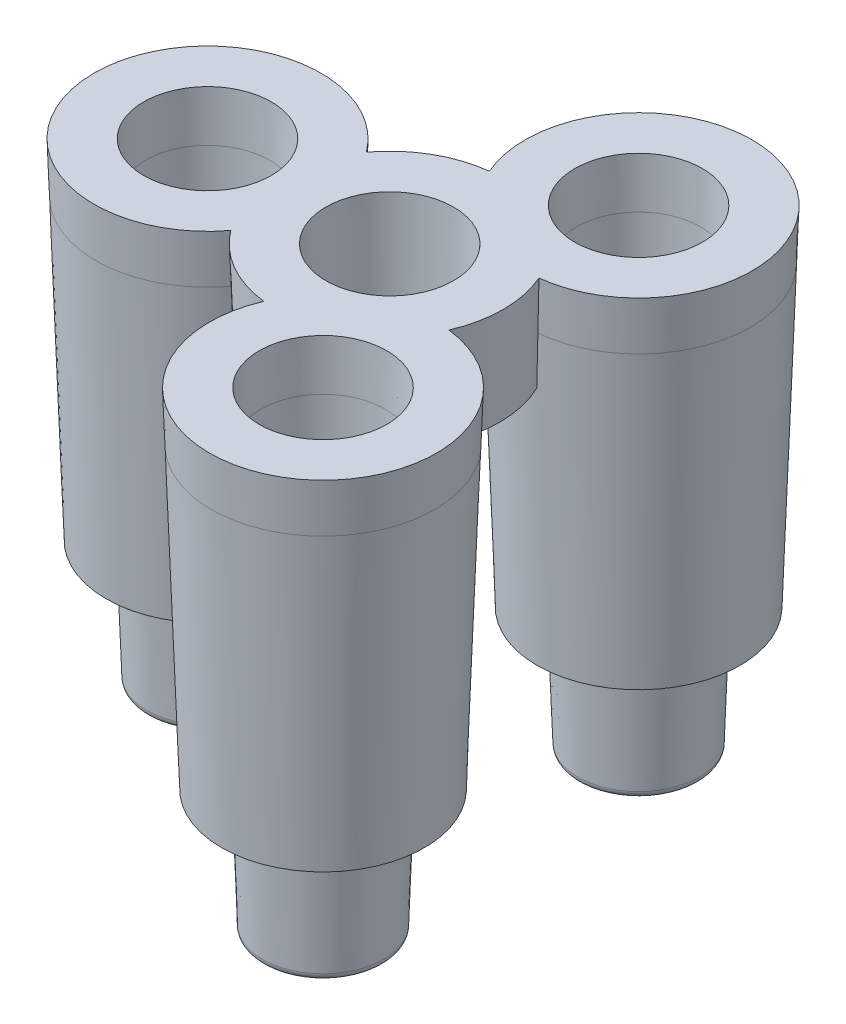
ISO-10303-21;
HEADER;
FILE_DESCRIPTION(('STEP AP214'),'2;1');
FILE_NAME('part.step','',(''),(''),'','','');
FILE_SCHEMA(('AUTOMOTIVE_DESIGN { 1 0 10303 214 1 1 1 1 }'));
ENDSEC;
DATA;
#1=APPLICATION_CONTEXT('core data for automotive mechanical design processes');
#2=APPLICATION_PROTOCOL_DEFINITION('international standard','automotive_design',2000,#1);
#3=PRODUCT_CONTEXT('',#1,'mechanical');
#4=PRODUCT('Part','Part','',(#3));
#5=PRODUCT_RELATED_PRODUCT_CATEGORY('part','',(#4));
#6=PRODUCT_DEFINITION_FORMATION('','',#4);
#7=PRODUCT_DEFINITION_CONTEXT('part definition',#1,'design');
#8=PRODUCT_DEFINITION('design','',#6,#7);
#9=PRODUCT_DEFINITION_SHAPE('','',#8);
#10=(LENGTH_UNIT() NAMED_UNIT(*) SI_UNIT(.MILLI.,.METRE.));
#11=(NAMED_UNIT(*) PLANE_ANGLE_UNIT() SI_UNIT($,.RADIAN.));
#12=(NAMED_UNIT(*) SI_UNIT($,.STERADIAN.) SOLID_ANGLE_UNIT());
#13=UNCERTAINTY_MEASURE_WITH_UNIT(LENGTH_MEASURE(1.E-05),#10,'distance_accuracy_value','');
#14=(GEOMETRIC_REPRESENTATION_CONTEXT(3) GLOBAL_UNCERTAINTY_ASSIGNED_CONTEXT((#13)) GLOBAL_UNIT_ASSIGNED_CONTEXT((#10,
#11,#12)) REPRESENTATION_CONTEXT('',''));
#15=CARTESIAN_POINT('',(0.,0.,0.));
#16=DIRECTION('',(0.,0.,1.));
#17=DIRECTION('',(1.,0.,0.));
#18=AXIS2_PLACEMENT_3D('',#15,#16,#17);
#19=CARTESIAN_POINT('',(7.33333333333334,0.,0.));
#20=DIRECTION('',(0.,1.,0.));
#21=DIRECTION('',(-0.866025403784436,0.,-0.500000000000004));
#22=AXIS2_PLACEMENT_3D('',#19,#20,#21);
#23=CONICAL_SURFACE('',#22,4.5,0.0349065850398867);
#24=CARTESIAN_POINT('',(11.4363348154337,0.2002,1.86503296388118));
#25=CARTESIAN_POINT('',(11.4155381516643,-0.199895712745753,1.8770399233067));
#26=CARTESIAN_POINT('',(11.3945360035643,-0.599976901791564,1.88916551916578));
#27=CARTESIAN_POINT('',(11.3521207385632,-1.40011023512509,1.91365398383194));
#28=CARTESIAN_POINT('',(11.3307076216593,-1.80016237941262,1.92601685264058));
#29=CARTESIAN_POINT('',(11.3090890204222,-2.20020000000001,1.93849835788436));
#30=B_SPLINE_CURVE_WITH_KNOTS('',3,(#24,#25,#26,#27,#28,#29),.UNSPECIFIED.,.F.,.F.,(4,2,4),(0.,
1.20244654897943,2.40489310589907),.UNSPECIFIED.);
#31=CARTESIAN_POINT('',(11.4259069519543,0.,1.8710534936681));
#32=VERTEX_POINT('',#31);
#33=CARTESIAN_POINT('',(11.3198955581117,-2.,1.93225920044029));
#34=VERTEX_POINT('',#33);
#35=EDGE_CURVE('E380',#32,#34,#30,.T.);
#36=ORIENTED_EDGE('',*,*,#35,.T.);
#37=CARTESIAN_POINT('',(7.33333333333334,-2.,0.));
#38=DIRECTION('',(0.,-1.,0.));
#39=DIRECTION('',(0.866025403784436,0.,0.500000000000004));
#40=AXIS2_PLACEMENT_3D('',#37,#38,#39);
#41=CIRCLE('',#40,4.43015846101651);
#42=CARTESIAN_POINT('',(11.3198955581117,-2.,-1.93225920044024));
#43=VERTEX_POINT('',#42);
#44=EDGE_CURVE('E271',#43,#34,#41,.T.);
#45=ORIENTED_EDGE('',*,*,#44,.F.);
#46=CARTESIAN_POINT('',(11.3090890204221,-2.2002,-1.93849835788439));
#47=CARTESIAN_POINT('',(11.3307076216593,-1.80016237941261,-1.92601685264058));
#48=CARTESIAN_POINT('',(11.3521207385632,-1.40011023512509,-1.91365398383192));
#49=CARTESIAN_POINT('',(11.3945360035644,-0.599976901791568,-1.88916551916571));
#50=CARTESIAN_POINT('',(11.4155381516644,-0.19989571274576,-1.8770399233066));
#51=CARTESIAN_POINT('',(11.4363348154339,0.20019999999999,-1.86503296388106));
#52=B_SPLINE_CURVE_WITH_KNOTS('',3,(#46,#47,#48,#49,#50,#51),.UNSPECIFIED.,.F.,.F.,(4,2,4),(0.,
1.20244655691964,2.40489310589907),.UNSPECIFIED.);
#53=CARTESIAN_POINT('',(11.4259069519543,0.,-1.87105349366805));
#54=VERTEX_POINT('',#53);
#55=EDGE_CURVE('E234',#43,#54,#52,.T.);
#56=ORIENTED_EDGE('',*,*,#55,.T.);
#57=CARTESIAN_POINT('',(11.4154470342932,-0.2002,-1.87709252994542));
#58=CARTESIAN_POINT('',(11.4363706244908,0.19984214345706,-1.86501228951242));
#59=CARTESIAN_POINT('',(11.4571153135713,0.599896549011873,-1.85303533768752));
#60=CARTESIAN_POINT('',(11.4982468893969,1.40002988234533,-1.82928801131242));
#61=CARTESIAN_POINT('',(11.5186337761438,1.80010881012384,-1.81751763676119));
#62=CARTESIAN_POINT('',(11.5388417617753,2.2002,-1.80585055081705));
#63=B_SPLINE_CURVE_WITH_KNOTS('',3,(#57,#58,#59,#60,#61,#62),.UNSPECIFIED.,.F.,.F.,(4,2,4),(0.,
1.20231270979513,2.40462541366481),.UNSPECIFIED.);
#64=CARTESIAN_POINT('',(11.5287114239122,2.,-1.8116993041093));
#65=VERTEX_POINT('',#64);
#66=EDGE_CURVE('E198',#54,#65,#63,.T.);
#67=ORIENTED_EDGE('',*,*,#66,.T.);
#68=CARTESIAN_POINT('',(7.33333333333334,2.,0.));
#69=DIRECTION('',(0.,1.,0.));
#70=DIRECTION('',(-0.866025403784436,0.,-0.500000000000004));
#71=AXIS2_PLACEMENT_3D('',#68,#69,#70);
#72=CIRCLE('',#71,4.5698415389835);
#73=CARTESIAN_POINT('',(11.5287114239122,2.,1.81169930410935));
#74=VERTEX_POINT('',#73);
#75=EDGE_CURVE('E343',#74,#65,#72,.T.);
#76=ORIENTED_EDGE('',*,*,#75,.F.);
#77=CARTESIAN_POINT('',(11.5388417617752,2.2002,1.80585055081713));
#78=CARTESIAN_POINT('',(11.5186337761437,1.80010881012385,1.81751763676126));
#79=CARTESIAN_POINT('',(11.4982468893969,1.40002988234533,1.82928801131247));
#80=CARTESIAN_POINT('',(11.4571153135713,0.599896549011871,1.85303533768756));
#81=CARTESIAN_POINT('',(11.4363706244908,0.199842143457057,1.86501228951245));
#82=CARTESIAN_POINT('',(11.4154470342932,-0.200200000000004,1.87709252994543));
#83=B_SPLINE_CURVE_WITH_KNOTS('',3,(#77,#78,#79,#80,#81,#82),.UNSPECIFIED.,.F.,.F.,(4,2,4),(0.,
1.20231270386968,2.40462541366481),.UNSPECIFIED.);
#84=EDGE_CURVE('E395',#74,#32,#83,.T.);
#85=ORIENTED_EDGE('',*,*,#84,.T.);
#86=EDGE_LOOP('',(#36,#45,#56,#67,#76,#85));
#87=FACE_BOUND('',#86,.T.);
#88=ADVANCED_FACE('F36',(#87),#23,.T.);
#89=CARTESIAN_POINT('',(7.33333333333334,0.,0.));
#90=DIRECTION('',(0.,1.,0.));
#91=DIRECTION('',(-0.866025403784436,0.,-0.500000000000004));
#92=AXIS2_PLACEMENT_3D('',#89,#90,#91);
#93=CONICAL_SURFACE('',#92,4.5,0.0349065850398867);
#94=CARTESIAN_POINT('',(3.66666666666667,-2.2002,-2.47385624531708));
#95=CARTESIAN_POINT('',(3.66666666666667,-1.80016237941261,-2.49881925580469));
#96=CARTESIAN_POINT('',(3.66666666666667,-1.40011023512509,-2.52354499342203));
#97=CARTESIAN_POINT('',(3.66666666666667,-0.599976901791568,-2.57252192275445));
#98=CARTESIAN_POINT('',(3.66666666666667,-0.19989571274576,-2.59677311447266));
#99=CARTESIAN_POINT('',(3.66666666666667,0.20019999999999,-2.62078703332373));
#100=B_SPLINE_CURVE_WITH_KNOTS('',3,(#94,#95,#96,#97,#98,#99),.UNSPECIFIED.,.F.,.F.,(4,2,4),(0.,
1.20244655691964,2.40489310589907),.UNSPECIFIED.);
#101=CARTESIAN_POINT('',(3.66666666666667,-2.,-2.48633456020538));
#102=VERTEX_POINT('',#101);
#103=CARTESIAN_POINT('',(3.66666666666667,0.,-2.60874597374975));
#104=VERTEX_POINT('',#103);
#105=EDGE_CURVE('E52',#102,#104,#100,.T.);
#106=ORIENTED_EDGE('',*,*,#105,.T.);
#107=CARTESIAN_POINT('',(3.66666666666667,-0.2002,-2.59666790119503));
#108=CARTESIAN_POINT('',(3.66666666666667,0.19984214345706,-2.62082838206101));
#109=CARTESIAN_POINT('',(3.66666666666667,0.599896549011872,-2.64478228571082));
#110=CARTESIAN_POINT('',(3.66666666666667,1.40002988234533,-2.69227693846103));
#111=CARTESIAN_POINT('',(3.66666666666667,1.80010881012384,-2.71581768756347));
#112=CARTESIAN_POINT('',(3.66666666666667,2.2002,-2.73915185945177));
#113=B_SPLINE_CURVE_WITH_KNOTS('',3,(#107,#108,#109,#110,#111,#112),.UNSPECIFIED.,.F.,.F.,(4,2,
4),(0.,1.20231270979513,2.40462541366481),.UNSPECIFIED.);
#114=CARTESIAN_POINT('',(3.66666666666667,2.,-2.72745435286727));
#115=VERTEX_POINT('',#114);
#116=EDGE_CURVE('E110',#104,#115,#113,.T.);
#117=ORIENTED_EDGE('',*,*,#116,.T.);
#118=CARTESIAN_POINT('',(7.33333333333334,2.,0.));
#119=DIRECTION('',(0.,1.,0.));
#120=DIRECTION('',(-0.866025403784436,0.,-0.500000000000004));
#121=AXIS2_PLACEMENT_3D('',#118,#119,#120);
#122=CIRCLE('',#121,4.5698415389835);
#123=CARTESIAN_POINT('',(6.80462190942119,2.,-4.53915365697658));
#124=VERTEX_POINT('',#123);
#125=EDGE_CURVE('E476',#124,#115,#122,.T.);
#126=ORIENTED_EDGE('',*,*,#125,.F.);
#127=CARTESIAN_POINT('',(6.79449157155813,2.2002,-4.5450024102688));
#128=CARTESIAN_POINT('',(6.81469955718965,1.80010881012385,-4.53333532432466));
#129=CARTESIAN_POINT('',(6.83508644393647,1.40002988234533,-4.52156494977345));
#130=CARTESIAN_POINT('',(6.87621801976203,0.599896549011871,-4.49781762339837));
#131=CARTESIAN_POINT('',(6.89696270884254,0.199842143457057,-4.48584067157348));
#132=CARTESIAN_POINT('',(6.91788629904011,-0.200200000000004,-4.4737604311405));
#133=B_SPLINE_CURVE_WITH_KNOTS('',3,(#127,#128,#129,#130,#131,#132),.UNSPECIFIED.,.F.,.F.,(4,2,
4),(0.,1.20231270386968,2.40462541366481),.UNSPECIFIED.);
#134=CARTESIAN_POINT('',(6.90742638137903,0.,-4.47979946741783));
#135=VERTEX_POINT('',#134);
#136=EDGE_CURVE('E207',#124,#135,#133,.T.);
#137=ORIENTED_EDGE('',*,*,#136,.T.);
#138=CARTESIAN_POINT('',(6.89699851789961,0.2002,-4.48581999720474));
#139=CARTESIAN_POINT('',(6.91779518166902,-0.199895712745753,-4.47381303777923));
#140=CARTESIAN_POINT('',(6.93879732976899,-0.599976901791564,-4.46168744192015));
#141=CARTESIAN_POINT('',(6.98121259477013,-1.40011023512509,-4.43719897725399));
#142=CARTESIAN_POINT('',(7.00262571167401,-1.80016237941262,-4.42483610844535));
#143=CARTESIAN_POINT('',(7.02424431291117,-2.20020000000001,-4.41235460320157));
#144=B_SPLINE_CURVE_WITH_KNOTS('',3,(#138,#139,#140,#141,#142,#143),.UNSPECIFIED.,.F.,.F.,(4,2,
4),(0.,1.20244654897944,2.40489310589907),.UNSPECIFIED.);
#145=CARTESIAN_POINT('',(7.01343777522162,-2.,-4.41859376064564));
#146=VERTEX_POINT('',#145);
#147=EDGE_CURVE('E241',#135,#146,#144,.T.);
#148=ORIENTED_EDGE('',*,*,#147,.T.);
#149=CARTESIAN_POINT('',(7.33333333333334,-2.,0.));
#150=DIRECTION('',(0.,-1.,0.));
#151=DIRECTION('',(0.866025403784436,0.,0.500000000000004));
#152=AXIS2_PLACEMENT_3D('',#149,#150,#151);
#153=CIRCLE('',#152,4.43015846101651);
#154=EDGE_CURVE('E130',#102,#146,#153,.T.);
#155=ORIENTED_EDGE('',*,*,#154,.F.);
#156=EDGE_LOOP('',(#106,#117,#126,#137,#148,#155));
#157=FACE_BOUND('',#156,.T.);
#158=ADVANCED_FACE('F128',(#157),#93,.T.);
#159=CARTESIAN_POINT('',(7.33333333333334,0.,0.));
#160=DIRECTION('',(0.,1.,0.));
#161=DIRECTION('',(-0.866025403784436,0.,-0.500000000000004));
#162=AXIS2_PLACEMENT_3D('',#159,#160,#161);
#163=CONICAL_SURFACE('',#162,4.5,0.0349065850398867);
#164=CARTESIAN_POINT('',(7.02424431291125,-2.2002,4.41235460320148));
#165=CARTESIAN_POINT('',(7.00262571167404,-1.80016237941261,4.42483610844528));
#166=CARTESIAN_POINT('',(6.98121259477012,-1.40011023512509,4.43719897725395));
#167=CARTESIAN_POINT('',(6.93879732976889,-0.599976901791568,4.46168744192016));
#168=CARTESIAN_POINT('',(6.91779518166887,-0.19989571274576,4.47381303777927));
#169=CARTESIAN_POINT('',(6.89699851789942,0.20019999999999,4.4858199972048));
#170=B_SPLINE_CURVE_WITH_KNOTS('',3,(#164,#165,#166,#167,#168,#169),.UNSPECIFIED.,.F.,.F.,(4,2,
4),(0.,1.20244655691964,2.40489310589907),.UNSPECIFIED.);
#171=CARTESIAN_POINT('',(7.01343777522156,-2.,4.41859376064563));
#172=VERTEX_POINT('',#171);
#173=CARTESIAN_POINT('',(6.90742638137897,0.,4.47979946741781));
#174=VERTEX_POINT('',#173);
#175=EDGE_CURVE('E60',#172,#174,#170,.T.);
#176=ORIENTED_EDGE('',*,*,#175,.T.);
#177=CARTESIAN_POINT('',(6.91788629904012,-0.2002,4.47376043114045));
#178=CARTESIAN_POINT('',(6.89696270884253,0.19984214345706,4.48584067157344));
#179=CARTESIAN_POINT('',(6.87621801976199,0.599896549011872,4.49781762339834));
#180=CARTESIAN_POINT('',(6.83508644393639,1.40002988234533,4.52156494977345));
#181=CARTESIAN_POINT('',(6.81469955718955,1.80010881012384,4.53333532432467));
#182=CARTESIAN_POINT('',(6.79449157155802,2.2002,4.54500241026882));
#183=B_SPLINE_CURVE_WITH_KNOTS('',3,(#177,#178,#179,#180,#181,#182),.UNSPECIFIED.,.F.,.F.,(4,2,
4),(0.,1.20231270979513,2.40462541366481),.UNSPECIFIED.);
#184=CARTESIAN_POINT('',(6.80462190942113,2.,4.53915365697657));
#185=VERTEX_POINT('',#184);
#186=EDGE_CURVE('E402',#174,#185,#183,.T.);
#187=ORIENTED_EDGE('',*,*,#186,.T.);
#188=CARTESIAN_POINT('',(7.33333333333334,2.,0.));
#189=DIRECTION('',(0.,1.,0.));
#190=DIRECTION('',(-0.866025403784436,0.,-0.500000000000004));
#191=AXIS2_PLACEMENT_3D('',#188,#189,#190);
#192=CIRCLE('',#191,4.5698415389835);
#193=CARTESIAN_POINT('',(3.66666666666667,2.,2.72745435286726));
#194=VERTEX_POINT('',#193);
#195=EDGE_CURVE('E474',#194,#185,#192,.T.);
#196=ORIENTED_EDGE('',*,*,#195,.F.);
#197=CARTESIAN_POINT('',(3.66666666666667,2.2002,2.7391518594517));
#198=CARTESIAN_POINT('',(3.66666666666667,1.80010881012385,2.71581768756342));
#199=CARTESIAN_POINT('',(3.66666666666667,1.40002988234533,2.692276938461));
#200=CARTESIAN_POINT('',(3.66666666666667,0.599896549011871,2.64478228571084));
#201=CARTESIAN_POINT('',(3.66666666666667,0.199842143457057,2.62082838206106));
#202=CARTESIAN_POINT('',(3.66666666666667,-0.200200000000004,2.59666790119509));
#203=B_SPLINE_CURVE_WITH_KNOTS('',3,(#197,#198,#199,#200,#201,#202),.UNSPECIFIED.,.F.,.F.,(4,2,
4),(0.,1.20231270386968,2.40462541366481),.UNSPECIFIED.);
#204=CARTESIAN_POINT('',(3.66666666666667,0.,2.60874597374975));
#205=VERTEX_POINT('',#204);
#206=EDGE_CURVE('E119',#194,#205,#203,.T.);
#207=ORIENTED_EDGE('',*,*,#206,.T.);
#208=CARTESIAN_POINT('',(3.66666666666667,0.2002,2.62078703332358));
#209=CARTESIAN_POINT('',(3.66666666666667,-0.199895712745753,2.59677311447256));
#210=CARTESIAN_POINT('',(3.66666666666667,-0.599976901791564,2.57252192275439));
#211=CARTESIAN_POINT('',(3.66666666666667,-1.40011023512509,2.52354499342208));
#212=CARTESIAN_POINT('',(3.66666666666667,-1.80016237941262,2.49881925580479));
#213=CARTESIAN_POINT('',(3.66666666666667,-2.20020000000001,2.47385624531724));
#214=B_SPLINE_CURVE_WITH_KNOTS('',3,(#208,#209,#210,#211,#212,#213),.UNSPECIFIED.,.F.,.F.,(4,2,
4),(0.,1.20244654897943,2.40489310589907),.UNSPECIFIED.);
#215=CARTESIAN_POINT('',(3.66666666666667,-2.,2.48633456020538));
#216=VERTEX_POINT('',#215);
#217=EDGE_CURVE('E123',#205,#216,#214,.T.);
#218=ORIENTED_EDGE('',*,*,#217,.T.);
#219=CARTESIAN_POINT('',(7.33333333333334,-2.,0.));
#220=DIRECTION('',(0.,-1.,0.));
#221=DIRECTION('',(0.866025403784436,0.,0.500000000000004));
#222=AXIS2_PLACEMENT_3D('',#219,#220,#221);
#223=CIRCLE('',#222,4.43015846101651);
#224=EDGE_CURVE('E281',#172,#216,#223,.T.);
#225=ORIENTED_EDGE('',*,*,#224,.F.);
#226=EDGE_LOOP('',(#176,#187,#196,#207,#218,#225));
#227=FACE_BOUND('',#226,.T.);
#228=ADVANCED_FACE('F189',(#227),#163,.T.);
#229=CARTESIAN_POINT('',(3.66666666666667,-2.,0.));
#230=DIRECTION('',(0.,-1.,0.));
#231=DIRECTION('',(0.866025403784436,0.,0.500000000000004));
#232=AXIS2_PLACEMENT_3D('',#229,#230,#231);
#233=PLANE('',#232);
#234=CARTESIAN_POINT('',(7.33333333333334,-2.,0.));
#235=DIRECTION('',(0.,-1.,0.));
#236=DIRECTION('',(0.866025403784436,0.,0.500000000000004));
#237=AXIS2_PLACEMENT_3D('',#234,#235,#236);
#238=CIRCLE('',#237,2.4301584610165);
#239=CARTESIAN_POINT('',(9.43791229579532,-2.,1.21507923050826));
#240=VERTEX_POINT('',#239);
#241=EDGE_CURVE('E40',#240,#240,#238,.T.);
#242=ORIENTED_EDGE('',*,*,#241,.F.);
#243=EDGE_LOOP('',(#242));
#244=FACE_BOUND('',#243,.T.);
#245=ORIENTED_EDGE('',*,*,#44,.T.);
#246=CARTESIAN_POINT('',(10.9999999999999,-2.,6.35085296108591));
#247=DIRECTION('',(0.,-1.,0.));
#248=DIRECTION('',(-0.866025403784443,0.,0.499999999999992));
#249=AXIS2_PLACEMENT_3D('',#246,#247,#248);
#250=CIRCLE('',#249,4.4301584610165);
#251=EDGE_CURVE('E270',#172,#34,#250,.T.);
#252=ORIENTED_EDGE('',*,*,#251,.F.);
#253=ORIENTED_EDGE('',*,*,#224,.T.);
#254=CARTESIAN_POINT('',(0.,-2.,0.));
#255=DIRECTION('',(0.,-1.,0.));
#256=DIRECTION('',(0.,0.,-1.));
#257=AXIS2_PLACEMENT_3D('',#254,#255,#256);
#258=CIRCLE('',#257,4.4301584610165);
#259=EDGE_CURVE('E372',#102,#216,#258,.T.);
#260=ORIENTED_EDGE('',*,*,#259,.F.);
#261=ORIENTED_EDGE('',*,*,#154,.T.);
#262=CARTESIAN_POINT('',(11.,-2.,-6.35085296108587));
#263=DIRECTION('',(0.,-1.,0.));
#264=DIRECTION('',(0.866025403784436,0.,0.500000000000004));
#265=AXIS2_PLACEMENT_3D('',#262,#263,#264);
#266=CIRCLE('',#265,4.4301584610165);
#267=EDGE_CURVE('E12',#43,#146,#266,.T.);
#268=ORIENTED_EDGE('',*,*,#267,.F.);
#269=EDGE_LOOP('',(#245,#252,#253,#260,#261,#268));
#270=FACE_BOUND('',#269,.T.);
#271=ADVANCED_FACE('F230',(#244,#270),#233,.T.);
#272=CARTESIAN_POINT('',(11.,0.,-6.35085296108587));
#273=DIRECTION('',(0.,1.,0.));
#274=DIRECTION('',(0.866025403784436,0.,0.500000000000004));
#275=AXIS2_PLACEMENT_3D('',#272,#273,#274);
#276=CONICAL_SURFACE('',#275,4.5,0.0349065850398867);
#277=CARTESIAN_POINT('',(11.,-12.,-6.35085296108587));
#278=DIRECTION('',(0.,-1.,0.));
#279=DIRECTION('',(0.866025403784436,0.,0.500000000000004));
#280=AXIS2_PLACEMENT_3D('',#277,#278,#279);
#281=CIRCLE('',#280,4.08095076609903);
#282=CARTESIAN_POINT('',(14.5342070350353,-12.,-4.31037757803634));
#283=VERTEX_POINT('',#282);
#284=EDGE_CURVE('E206',#283,#283,#281,.T.);
#285=ORIENTED_EDGE('',*,*,#284,.F.);
#286=EDGE_LOOP('',(#285));
#287=FACE_BOUND('',#286,.T.);
#288=ORIENTED_EDGE('',*,*,#147,.F.);
#289=CARTESIAN_POINT('',(11.,0.,-6.35085296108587));
#290=DIRECTION('',(0.,-1.,0.));
#291=DIRECTION('',(0.866025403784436,0.,0.500000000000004));
#292=AXIS2_PLACEMENT_3D('',#289,#290,#291);
#293=CIRCLE('',#292,4.5);
#294=EDGE_CURVE('E294',#135,#54,#293,.T.);
#295=ORIENTED_EDGE('',*,*,#294,.T.);
#296=ORIENTED_EDGE('',*,*,#55,.F.);
#297=ORIENTED_EDGE('',*,*,#267,.T.);
#298=EDGE_LOOP('',(#288,#295,#296,#297));
#299=FACE_BOUND('',#298,.T.);
#300=ADVANCED_FACE('F219',(#287,#299),#276,.T.);
#301=CARTESIAN_POINT('',(11.,0.,-6.35085296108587));
#302=DIRECTION('',(0.,1.,0.));
#303=DIRECTION('',(-0.866025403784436,0.,-0.500000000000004));
#304=AXIS2_PLACEMENT_3D('',#301,#302,#303);
#305=CONICAL_SURFACE('',#304,4.5,0.0349065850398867);
#306=ORIENTED_EDGE('',*,*,#66,.F.);
#307=ORIENTED_EDGE('',*,*,#294,.F.);
#308=ORIENTED_EDGE('',*,*,#136,.F.);
#309=CARTESIAN_POINT('',(11.,2.,-6.35085296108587));
#310=DIRECTION('',(0.,1.,0.));
#311=DIRECTION('',(-0.866025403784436,0.,-0.500000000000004));
#312=AXIS2_PLACEMENT_3D('',#309,#310,#311);
#313=CIRCLE('',#312,4.56984153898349);
#314=EDGE_CURVE('E296',#65,#124,#313,.T.);
#315=ORIENTED_EDGE('',*,*,#314,.F.);
#316=EDGE_LOOP('',(#306,#307,#308,#315));
#317=FACE_BOUND('',#316,.T.);
#318=ADVANCED_FACE('F213',(#317),#305,.T.);
#319=CARTESIAN_POINT('',(11.,2.,-6.35085296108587));
#320=DIRECTION('',(0.,1.,0.));
#321=DIRECTION('',(-0.866025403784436,0.,-0.500000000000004));
#322=AXIS2_PLACEMENT_3D('',#319,#320,#321);
#323=PLANE('',#322);
#324=ORIENTED_EDGE('',*,*,#75,.T.);
#325=ORIENTED_EDGE('',*,*,#314,.T.);
#326=ORIENTED_EDGE('',*,*,#125,.T.);
#327=CARTESIAN_POINT('',(0.,2.,0.));
#328=DIRECTION('',(0.,1.,0.));
#329=DIRECTION('',(0.,0.,1.));
#330=AXIS2_PLACEMENT_3D('',#327,#328,#329);
#331=CIRCLE('',#330,4.56984153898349);
#332=EDGE_CURVE('E115',#115,#194,#331,.T.);
#333=ORIENTED_EDGE('',*,*,#332,.T.);
#334=ORIENTED_EDGE('',*,*,#195,.T.);
#335=CARTESIAN_POINT('',(10.9999999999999,2.,6.35085296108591));
#336=DIRECTION('',(0.,1.,0.));
#337=DIRECTION('',(0.866025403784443,0.,-0.499999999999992));
#338=AXIS2_PLACEMENT_3D('',#335,#336,#337);
#339=CIRCLE('',#338,4.56984153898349);
#340=EDGE_CURVE('E436',#185,#74,#339,.T.);
#341=ORIENTED_EDGE('',*,*,#340,.T.);
#342=EDGE_LOOP('',(#324,#325,#326,#333,#334,#341));
#343=FACE_BOUND('',#342,.T.);
#344=CARTESIAN_POINT('',(7.33333333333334,2.,0.));
#345=DIRECTION('',(0.,-1.,0.));
#346=DIRECTION('',(0.866025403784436,0.,0.500000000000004));
#347=AXIS2_PLACEMENT_3D('',#344,#345,#346);
#348=CIRCLE('',#347,2.5698415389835);
#349=CARTESIAN_POINT('',(9.55888138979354,2.,1.28492076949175));
#350=VERTEX_POINT('',#349);
#351=EDGE_CURVE('E247',#350,#350,#348,.T.);
#352=ORIENTED_EDGE('',*,*,#351,.T.);
#353=EDGE_LOOP('',(#352));
#354=FACE_BOUND('',#353,.T.);
#355=CARTESIAN_POINT('',(10.9999999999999,2.,6.35085296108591));
#356=DIRECTION('',(0.,1.,0.));
#357=DIRECTION('',(0.866025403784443,0.,-0.499999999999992));
#358=AXIS2_PLACEMENT_3D('',#355,#356,#357);
#359=CIRCLE('',#358,2.56984153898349);
#360=CARTESIAN_POINT('',(13.2255480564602,2.,5.06593219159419));
#361=VERTEX_POINT('',#360);
#362=EDGE_CURVE('E348',#361,#361,#359,.T.);
#363=ORIENTED_EDGE('',*,*,#362,.F.);
#364=EDGE_LOOP('',(#363));
#365=FACE_BOUND('',#364,.T.);
#366=CARTESIAN_POINT('',(0.,2.,0.));
#367=DIRECTION('',(0.,1.,0.));
#368=DIRECTION('',(0.,0.,1.));
#369=AXIS2_PLACEMENT_3D('',#366,#367,#368);
#370=CIRCLE('',#369,2.56984153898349);
#371=CARTESIAN_POINT('',(0.,2.,2.56984153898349));
#372=VERTEX_POINT('',#371);
#373=EDGE_CURVE('E352',#372,#372,#370,.T.);
#374=ORIENTED_EDGE('',*,*,#373,.F.);
#375=EDGE_LOOP('',(#374));
#376=FACE_BOUND('',#375,.T.);
#377=CARTESIAN_POINT('',(11.,2.,-6.35085296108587));
#378=DIRECTION('',(0.,1.,0.));
#379=DIRECTION('',(-0.866025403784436,0.,-0.500000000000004));
#380=AXIS2_PLACEMENT_3D('',#377,#378,#379);
#381=CIRCLE('',#380,2.56984153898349);
#382=CARTESIAN_POINT('',(8.77445194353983,2.,-7.63577373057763));
#383=VERTEX_POINT('',#382);
#384=EDGE_CURVE('E302',#383,#383,#381,.T.);
#385=ORIENTED_EDGE('',*,*,#384,.F.);
#386=EDGE_LOOP('',(#385));
#387=FACE_BOUND('',#386,.T.);
#388=ADVANCED_FACE('F218',(#343,#354,#365,#376,#387),#323,.T.);
#389=CARTESIAN_POINT('',(11.,0.,-6.35085296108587));
#390=DIRECTION('',(0.,1.,0.));
#391=DIRECTION('',(-0.866025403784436,0.,-0.500000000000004));
#392=AXIS2_PLACEMENT_3D('',#389,#390,#391);
#393=CONICAL_SURFACE('',#392,2.5,0.0349065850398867);
#394=ORIENTED_EDGE('',*,*,#384,.T.);
#395=EDGE_LOOP('',(#394));
#396=FACE_BOUND('',#395,.T.);
#397=CARTESIAN_POINT('',(11.,0.,-6.35085296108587));
#398=DIRECTION('',(0.,1.,0.));
#399=DIRECTION('',(-0.866025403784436,0.,-0.500000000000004));
#400=AXIS2_PLACEMENT_3D('',#397,#398,#399);
#401=CIRCLE('',#400,2.5);
#402=CARTESIAN_POINT('',(8.83493649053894,0.,-7.60085296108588));
#403=VERTEX_POINT('',#402);
#404=EDGE_CURVE('E298',#403,#403,#401,.T.);
#405=ORIENTED_EDGE('',*,*,#404,.F.);
#406=EDGE_LOOP('',(#405));
#407=FACE_BOUND('',#406,.T.);
#408=ADVANCED_FACE('F221',(#396,#407),#393,.F.);
#409=CARTESIAN_POINT('',(11.,0.,-6.35085296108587));
#410=DIRECTION('',(0.,1.,0.));
#411=DIRECTION('',(-0.866025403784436,0.,-0.500000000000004));
#412=AXIS2_PLACEMENT_3D('',#409,#410,#411);
#413=CONICAL_SURFACE('',#412,2.5,0.0349065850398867);
#414=CARTESIAN_POINT('',(11.,-10.,-6.35085296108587));
#415=DIRECTION('',(0.,-1.,0.));
#416=DIRECTION('',(0.866025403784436,0.,0.500000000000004));
#417=AXIS2_PLACEMENT_3D('',#414,#415,#416);
#418=CIRCLE('',#417,2.15079230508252);
#419=CARTESIAN_POINT('',(12.8626407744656,-10.,-5.27545680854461));
#420=VERTEX_POINT('',#419);
#421=EDGE_CURVE('E299',#420,#420,#418,.T.);
#422=ORIENTED_EDGE('',*,*,#421,.T.);
#423=EDGE_LOOP('',(#422));
#424=FACE_BOUND('',#423,.T.);
#425=ORIENTED_EDGE('',*,*,#404,.T.);
#426=EDGE_LOOP('',(#425));
#427=FACE_BOUND('',#426,.T.);
#428=ADVANCED_FACE('F223',(#424,#427),#413,.F.);
#429=CARTESIAN_POINT('',(11.,-10.,-6.35085296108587));
#430=DIRECTION('',(0.,-1.,0.));
#431=DIRECTION('',(0.866025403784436,0.,0.500000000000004));
#432=AXIS2_PLACEMENT_3D('',#429,#430,#431);
#433=PLANE('',#432);
#434=ORIENTED_EDGE('',*,*,#421,.F.);
#435=EDGE_LOOP('',(#434));
#436=FACE_BOUND('',#435,.T.);
#437=ADVANCED_FACE('F226',(#436),#433,.F.);
#438=CARTESIAN_POINT('',(11.,-12.,-6.35085296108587));
#439=DIRECTION('',(0.,-1.,0.));
#440=DIRECTION('',(0.866025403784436,0.,0.500000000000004));
#441=AXIS2_PLACEMENT_3D('',#438,#439,#440);
#442=PLANE('',#441);
#443=CARTESIAN_POINT('',(11.,-12.,-6.35085296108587));
#444=DIRECTION('',(0.,-1.,0.));
#445=DIRECTION('',(0.866025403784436,0.,0.500000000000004));
#446=AXIS2_PLACEMENT_3D('',#443,#444,#445);
#447=CIRCLE('',#446,2.60476230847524);
#448=CARTESIAN_POINT('',(13.2557903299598,-12.,-5.04847180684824));
#449=VERTEX_POINT('',#448);
#450=EDGE_CURVE('E309',#449,#449,#447,.T.);
#451=ORIENTED_EDGE('',*,*,#450,.F.);
#452=EDGE_LOOP('',(#451));
#453=FACE_BOUND('',#452,.T.);
#454=ORIENTED_EDGE('',*,*,#284,.T.);
#455=EDGE_LOOP('',(#454));
#456=FACE_BOUND('',#455,.T.);
#457=ADVANCED_FACE('F327',(#453,#456),#442,.T.);
#458=CARTESIAN_POINT('',(11.,-15.,-6.35085296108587));
#459=DIRECTION('',(0.,1.,0.));
#460=DIRECTION('',(0.866025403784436,0.,0.500000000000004));
#461=AXIS2_PLACEMENT_3D('',#458,#459,#460);
#462=CONICAL_SURFACE('',#461,2.5,0.0349065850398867);
#463=CARTESIAN_POINT('',(11.,-16.7104698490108,-6.35085296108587));
#464=DIRECTION('',(0.,-1.,0.));
#465=DIRECTION('',(0.866025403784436,0.,0.500000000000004));
#466=AXIS2_PLACEMENT_3D('',#463,#464,#465);
#467=CIRCLE('',#466,2.44026907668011);
#468=CARTESIAN_POINT('',(13.1133350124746,-16.7104698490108,-5.13071842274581));
#469=VERTEX_POINT('',#468);
#470=EDGE_CURVE('E45',#469,#469,#467,.F.);
#471=ORIENTED_EDGE('',*,*,#470,.T.);
#472=EDGE_LOOP('',(#471));
#473=FACE_BOUND('',#472,.T.);
#474=ORIENTED_EDGE('',*,*,#450,.T.);
#475=EDGE_LOOP('',(#474));
#476=FACE_BOUND('',#475,.T.);
#477=ADVANCED_FACE('F318',(#473,#476),#462,.T.);
#478=CARTESIAN_POINT('',(11.,-17.,-6.35085296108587));
#479=DIRECTION('',(0.,-1.,0.));
#480=DIRECTION('',(0.866025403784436,0.,0.500000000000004));
#481=AXIS2_PLACEMENT_3D('',#478,#479,#480);
#482=PLANE('',#481);
#483=CARTESIAN_POINT('',(11.,-17.,-6.35085296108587));
#484=DIRECTION('',(0.,-1.,0.));
#485=DIRECTION('',(0.866025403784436,0.,0.500000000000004));
#486=AXIS2_PLACEMENT_3D('',#483,#484,#485);
#487=CIRCLE('',#486,2.14045182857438);
#488=CARTESIAN_POINT('',(12.8536856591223,-17.,-5.28062704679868));
#489=VERTEX_POINT('',#488);
#490=EDGE_CURVE('E312',#489,#489,#487,.T.);
#491=ORIENTED_EDGE('',*,*,#490,.T.);
#492=EDGE_LOOP('',(#491));
#493=FACE_BOUND('',#492,.T.);
#494=ADVANCED_FACE('F262',(#493),#482,.T.);
#495=CARTESIAN_POINT('',(11.,-16.7,-6.35085296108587));
#496=DIRECTION('',(0.,-1.,0.));
#497=DIRECTION('',(0.866025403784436,0.,0.500000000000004));
#498=AXIS2_PLACEMENT_3D('',#495,#496,#497);
#499=TOROIDAL_SURFACE('',#498,2.14045182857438,0.3);
#500=ORIENTED_EDGE('',*,*,#470,.F.);
#501=EDGE_LOOP('',(#500));
#502=FACE_BOUND('',#501,.T.);
#503=ORIENTED_EDGE('',*,*,#490,.F.);
#504=EDGE_LOOP('',(#503));
#505=FACE_BOUND('',#504,.T.);
#506=ADVANCED_FACE('F38',(#502,#505),#499,.T.);
#507=CARTESIAN_POINT('',(7.33333333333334,0.,0.));
#508=DIRECTION('',(0.,1.,0.));
#509=DIRECTION('',(0.866025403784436,0.,0.500000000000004));
#510=AXIS2_PLACEMENT_3D('',#507,#508,#509);
#511=CONICAL_SURFACE('',#510,2.5,0.0349065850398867);
#512=ORIENTED_EDGE('',*,*,#351,.F.);
#513=EDGE_LOOP('',(#512));
#514=FACE_BOUND('',#513,.T.);
#515=ORIENTED_EDGE('',*,*,#241,.T.);
#516=EDGE_LOOP('',(#515));
#517=FACE_BOUND('',#516,.T.);
#518=ADVANCED_FACE('F253',(#514,#517),#511,.F.);
#519=CARTESIAN_POINT('',(0.,-17.,0.));
#520=DIRECTION('',(0.,-1.,0.));
#521=DIRECTION('',(0.,0.,-1.));
#522=AXIS2_PLACEMENT_3D('',#519,#520,#521);
#523=PLANE('',#522);
#524=CARTESIAN_POINT('',(0.,-17.,0.));
#525=DIRECTION('',(0.,-1.,0.));
#526=DIRECTION('',(0.,0.,-1.));
#527=AXIS2_PLACEMENT_3D('',#524,#525,#526);
#528=CIRCLE('',#527,2.14045182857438);
#529=CARTESIAN_POINT('',(0.,-17.,-2.14045182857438));
#530=VERTEX_POINT('',#529);
#531=EDGE_CURVE('E366',#530,#530,#528,.T.);
#532=ORIENTED_EDGE('',*,*,#531,.T.);
#533=EDGE_LOOP('',(#532));
#534=FACE_BOUND('',#533,.T.);
#535=ADVANCED_FACE('F255',(#534),#523,.T.);
#536=CARTESIAN_POINT('',(0.,-10.,0.));
#537=DIRECTION('',(0.,-1.,0.));
#538=DIRECTION('',(0.,0.,-1.));
#539=AXIS2_PLACEMENT_3D('',#536,#537,#538);
#540=PLANE('',#539);
#541=CARTESIAN_POINT('',(0.,-10.,0.));
#542=DIRECTION('',(0.,-1.,0.));
#543=DIRECTION('',(0.,0.,-1.));
#544=AXIS2_PLACEMENT_3D('',#541,#542,#543);
#545=CIRCLE('',#544,2.15079230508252);
#546=CARTESIAN_POINT('',(0.,-10.,-2.15079230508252));
#547=VERTEX_POINT('',#546);
#548=EDGE_CURVE('E125',#547,#547,#545,.T.);
#549=ORIENTED_EDGE('',*,*,#548,.F.);
#550=EDGE_LOOP('',(#549));
#551=FACE_BOUND('',#550,.T.);
#552=ADVANCED_FACE('F179',(#551),#540,.F.);
#553=CARTESIAN_POINT('',(0.,-16.7,0.));
#554=DIRECTION('',(0.,-1.,0.));
#555=DIRECTION('',(0.,0.,-1.));
#556=AXIS2_PLACEMENT_3D('',#553,#554,#555);
#557=TOROIDAL_SURFACE('',#556,2.14045182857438,0.3);
#558=CARTESIAN_POINT('',(0.,-16.7104698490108,0.));
#559=DIRECTION('',(0.,-1.,0.));
#560=DIRECTION('',(0.,0.,-1.));
#561=AXIS2_PLACEMENT_3D('',#558,#559,#560);
#562=CIRCLE('',#561,2.44026907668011);
#563=CARTESIAN_POINT('',(0.,-16.7104698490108,-2.44026907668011));
#564=VERTEX_POINT('',#563);
#565=EDGE_CURVE('E369',#564,#564,#562,.F.);
#566=ORIENTED_EDGE('',*,*,#565,.F.);
#567=EDGE_LOOP('',(#566));
#568=FACE_BOUND('',#567,.T.);
#569=ORIENTED_EDGE('',*,*,#531,.F.);
#570=EDGE_LOOP('',(#569));
#571=FACE_BOUND('',#570,.T.);
#572=ADVANCED_FACE('F171',(#568,#571),#557,.T.);
#573=CARTESIAN_POINT('',(0.,0.,0.));
#574=DIRECTION('',(0.,1.,0.));
#575=DIRECTION('',(0.,0.,1.));
#576=AXIS2_PLACEMENT_3D('',#573,#574,#575);
#577=CONICAL_SURFACE('',#576,2.5,0.0349065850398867);
#578=ORIENTED_EDGE('',*,*,#548,.T.);
#579=EDGE_LOOP('',(#578));
#580=FACE_BOUND('',#579,.T.);
#581=CARTESIAN_POINT('',(0.,0.,0.));
#582=DIRECTION('',(0.,1.,0.));
#583=DIRECTION('',(0.,0.,1.));
#584=AXIS2_PLACEMENT_3D('',#581,#582,#583);
#585=CIRCLE('',#584,2.5);
#586=CARTESIAN_POINT('',(0.,0.,2.5));
#587=VERTEX_POINT('',#586);
#588=EDGE_CURVE('E124',#587,#587,#585,.T.);
#589=ORIENTED_EDGE('',*,*,#588,.T.);
#590=EDGE_LOOP('',(#589));
#591=FACE_BOUND('',#590,.T.);
#592=ADVANCED_FACE('F167',(#580,#591),#577,.F.);
#593=CARTESIAN_POINT('',(0.,-15.,0.));
#594=DIRECTION('',(0.,1.,0.));
#595=DIRECTION('',(0.,0.,-1.));
#596=AXIS2_PLACEMENT_3D('',#593,#594,#595);
#597=CONICAL_SURFACE('',#596,2.5,0.0349065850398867);
#598=ORIENTED_EDGE('',*,*,#565,.T.);
#599=EDGE_LOOP('',(#598));
#600=FACE_BOUND('',#599,.T.);
#601=CARTESIAN_POINT('',(0.,-12.,0.));
#602=DIRECTION('',(0.,-1.,0.));
#603=DIRECTION('',(0.,0.,-1.));
#604=AXIS2_PLACEMENT_3D('',#601,#602,#603);
#605=CIRCLE('',#604,2.60476230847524);
#606=CARTESIAN_POINT('',(0.,-12.,-2.60476230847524));
#607=VERTEX_POINT('',#606);
#608=EDGE_CURVE('E359',#607,#607,#605,.T.);
#609=ORIENTED_EDGE('',*,*,#608,.T.);
#610=EDGE_LOOP('',(#609));
#611=FACE_BOUND('',#610,.T.);
#612=ADVANCED_FACE('F170',(#600,#611),#597,.T.);
#613=CARTESIAN_POINT('',(0.,0.,0.));
#614=DIRECTION('',(0.,1.,0.));
#615=DIRECTION('',(0.,0.,1.));
#616=AXIS2_PLACEMENT_3D('',#613,#614,#615);
#617=CONICAL_SURFACE('',#616,2.5,0.0349065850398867);
#618=ORIENTED_EDGE('',*,*,#373,.T.);
#619=EDGE_LOOP('',(#618));
#620=FACE_BOUND('',#619,.T.);
#621=ORIENTED_EDGE('',*,*,#588,.F.);
#622=EDGE_LOOP('',(#621));
#623=FACE_BOUND('',#622,.T.);
#624=ADVANCED_FACE('F165',(#620,#623),#617,.F.);
#625=CARTESIAN_POINT('',(0.,-12.,0.));
#626=DIRECTION('',(0.,-1.,0.));
#627=DIRECTION('',(0.,0.,-1.));
#628=AXIS2_PLACEMENT_3D('',#625,#626,#627);
#629=PLANE('',#628);
#630=ORIENTED_EDGE('',*,*,#608,.F.);
#631=EDGE_LOOP('',(#630));
#632=FACE_BOUND('',#631,.T.);
#633=CARTESIAN_POINT('',(0.,-12.,0.));
#634=DIRECTION('',(0.,-1.,0.));
#635=DIRECTION('',(0.,0.,-1.));
#636=AXIS2_PLACEMENT_3D('',#633,#634,#635);
#637=CIRCLE('',#636,4.08095076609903);
#638=CARTESIAN_POINT('',(0.,-12.,-4.08095076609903));
#639=VERTEX_POINT('',#638);
#640=EDGE_CURVE('E118',#639,#639,#637,.T.);
#641=ORIENTED_EDGE('',*,*,#640,.T.);
#642=EDGE_LOOP('',(#641));
#643=FACE_BOUND('',#642,.T.);
#644=ADVANCED_FACE('F602',(#632,#643),#629,.T.);
#645=CARTESIAN_POINT('',(0.,0.,0.));
#646=DIRECTION('',(0.,1.,0.));
#647=DIRECTION('',(0.,0.,-1.));
#648=AXIS2_PLACEMENT_3D('',#645,#646,#647);
#649=CONICAL_SURFACE('',#648,4.5,0.0349065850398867);
#650=ORIENTED_EDGE('',*,*,#640,.F.);
#651=EDGE_LOOP('',(#650));
#652=FACE_BOUND('',#651,.T.);
#653=ORIENTED_EDGE('',*,*,#217,.F.);
#654=CARTESIAN_POINT('',(0.,0.,0.));
#655=DIRECTION('',(0.,-1.,0.));
#656=DIRECTION('',(0.,0.,-1.));
#657=AXIS2_PLACEMENT_3D('',#654,#655,#656);
#658=CIRCLE('',#657,4.5);
#659=EDGE_CURVE('E112',#205,#104,#658,.T.);
#660=ORIENTED_EDGE('',*,*,#659,.T.);
#661=ORIENTED_EDGE('',*,*,#105,.F.);
#662=ORIENTED_EDGE('',*,*,#259,.T.);
#663=EDGE_LOOP('',(#653,#660,#661,#662));
#664=FACE_BOUND('',#663,.T.);
#665=ADVANCED_FACE('F121',(#652,#664),#649,.T.);
#666=CARTESIAN_POINT('',(0.,0.,0.));
#667=DIRECTION('',(0.,1.,0.));
#668=DIRECTION('',(0.,0.,1.));
#669=AXIS2_PLACEMENT_3D('',#666,#667,#668);
#670=CONICAL_SURFACE('',#669,4.5,0.0349065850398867);
#671=ORIENTED_EDGE('',*,*,#116,.F.);
#672=ORIENTED_EDGE('',*,*,#659,.F.);
#673=ORIENTED_EDGE('',*,*,#206,.F.);
#674=ORIENTED_EDGE('',*,*,#332,.F.);
#675=EDGE_LOOP('',(#671,#672,#673,#674));
#676=FACE_BOUND('',#675,.T.);
#677=ADVANCED_FACE('F111',(#676),#670,.T.);
#678=CARTESIAN_POINT('',(10.9999999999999,0.,6.35085296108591));
#679=DIRECTION('',(0.,1.,0.));
#680=DIRECTION('',(-0.866025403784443,0.,0.499999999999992));
#681=AXIS2_PLACEMENT_3D('',#678,#679,#680);
#682=CONICAL_SURFACE('',#681,4.5,0.0349065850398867);
#683=CARTESIAN_POINT('',(10.9999999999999,-12.,6.35085296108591));
#684=DIRECTION('',(0.,-1.,0.));
#685=DIRECTION('',(-0.866025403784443,0.,0.499999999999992));
#686=AXIS2_PLACEMENT_3D('',#683,#684,#685);
#687=CIRCLE('',#686,4.08095076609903);
#688=CARTESIAN_POINT('',(7.46579296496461,-12.,8.39132834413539));
#689=VERTEX_POINT('',#688);
#690=EDGE_CURVE('E468',#689,#689,#687,.T.);
#691=ORIENTED_EDGE('',*,*,#690,.F.);
#692=EDGE_LOOP('',(#691));
#693=FACE_BOUND('',#692,.T.);
#694=ORIENTED_EDGE('',*,*,#35,.F.);
#695=CARTESIAN_POINT('',(10.9999999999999,0.,6.35085296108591));
#696=DIRECTION('',(0.,-1.,0.));
#697=DIRECTION('',(-0.866025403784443,0.,0.499999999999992));
#698=AXIS2_PLACEMENT_3D('',#695,#696,#697);
#699=CIRCLE('',#698,4.5);
#700=EDGE_CURVE('E434',#32,#174,#699,.T.);
#701=ORIENTED_EDGE('',*,*,#700,.T.);
#702=ORIENTED_EDGE('',*,*,#175,.F.);
#703=ORIENTED_EDGE('',*,*,#251,.T.);
#704=EDGE_LOOP('',(#694,#701,#702,#703));
#705=FACE_BOUND('',#704,.T.);
#706=ADVANCED_FACE('F164',(#693,#705),#682,.T.);
#707=CARTESIAN_POINT('',(10.9999999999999,0.,6.35085296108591));
#708=DIRECTION('',(0.,1.,0.));
#709=DIRECTION('',(0.866025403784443,0.,-0.499999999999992));
#710=AXIS2_PLACEMENT_3D('',#707,#708,#709);
#711=CONICAL_SURFACE('',#710,4.5,0.0349065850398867);
#712=ORIENTED_EDGE('',*,*,#186,.F.);
#713=ORIENTED_EDGE('',*,*,#700,.F.);
#714=ORIENTED_EDGE('',*,*,#84,.F.);
#715=ORIENTED_EDGE('',*,*,#340,.F.);
#716=EDGE_LOOP('',(#712,#713,#714,#715));
#717=FACE_BOUND('',#716,.T.);
#718=ADVANCED_FACE('F407',(#717),#711,.T.);
#719=CARTESIAN_POINT('',(10.9999999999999,0.,6.35085296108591));
#720=DIRECTION('',(0.,1.,0.));
#721=DIRECTION('',(0.866025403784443,0.,-0.499999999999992));
#722=AXIS2_PLACEMENT_3D('',#719,#720,#721);
#723=CONICAL_SURFACE('',#722,2.5,0.0349065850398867);
#724=ORIENTED_EDGE('',*,*,#362,.T.);
#725=EDGE_LOOP('',(#724));
#726=FACE_BOUND('',#725,.T.);
#727=CARTESIAN_POINT('',(10.9999999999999,0.,6.35085296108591));
#728=DIRECTION('',(0.,1.,0.));
#729=DIRECTION('',(0.866025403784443,0.,-0.499999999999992));
#730=AXIS2_PLACEMENT_3D('',#727,#728,#729);
#731=CIRCLE('',#730,2.5);
#732=CARTESIAN_POINT('',(13.1650635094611,0.,5.10085296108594));
#733=VERTEX_POINT('',#732);
#734=EDGE_CURVE('E432',#733,#733,#731,.T.);
#735=ORIENTED_EDGE('',*,*,#734,.F.);
#736=EDGE_LOOP('',(#735));
#737=FACE_BOUND('',#736,.T.);
#738=ADVANCED_FACE('F411',(#726,#737),#723,.F.);
#739=CARTESIAN_POINT('',(10.9999999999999,0.,6.35085296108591));
#740=DIRECTION('',(0.,1.,0.));
#741=DIRECTION('',(0.866025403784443,0.,-0.499999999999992));
#742=AXIS2_PLACEMENT_3D('',#739,#740,#741);
#743=CONICAL_SURFACE('',#742,2.5,0.0349065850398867);
#744=CARTESIAN_POINT('',(10.9999999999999,-10.,6.35085296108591));
#745=DIRECTION('',(0.,-1.,0.));
#746=DIRECTION('',(-0.866025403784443,0.,0.499999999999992));
#747=AXIS2_PLACEMENT_3D('',#744,#745,#746);
#748=CIRCLE('',#747,2.15079230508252);
#749=CARTESIAN_POINT('',(9.13735922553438,-10.,7.42624911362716));
#750=VERTEX_POINT('',#749);
#751=EDGE_CURVE('E429',#750,#750,#748,.T.);
#752=ORIENTED_EDGE('',*,*,#751,.T.);
#753=EDGE_LOOP('',(#752));
#754=FACE_BOUND('',#753,.T.);
#755=ORIENTED_EDGE('',*,*,#734,.T.);
#756=EDGE_LOOP('',(#755));
#757=FACE_BOUND('',#756,.T.);
#758=ADVANCED_FACE('F414',(#754,#757),#743,.F.);
#759=CARTESIAN_POINT('',(10.9999999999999,-10.,6.35085296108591));
#760=DIRECTION('',(0.,-1.,0.));
#761=DIRECTION('',(-0.866025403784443,0.,0.499999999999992));
#762=AXIS2_PLACEMENT_3D('',#759,#760,#761);
#763=PLANE('',#762);
#764=ORIENTED_EDGE('',*,*,#751,.F.);
#765=EDGE_LOOP('',(#764));
#766=FACE_BOUND('',#765,.T.);
#767=ADVANCED_FACE('F417',(#766),#763,.F.);
#768=CARTESIAN_POINT('',(10.9999999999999,-12.,6.35085296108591));
#769=DIRECTION('',(0.,-1.,0.));
#770=DIRECTION('',(-0.866025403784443,0.,0.499999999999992));
#771=AXIS2_PLACEMENT_3D('',#768,#769,#770);
#772=PLANE('',#771);
#773=CARTESIAN_POINT('',(10.9999999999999,-12.,6.35085296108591));
#774=DIRECTION('',(0.,-1.,0.));
#775=DIRECTION('',(-0.866025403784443,0.,0.499999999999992));
#776=AXIS2_PLACEMENT_3D('',#773,#774,#775);
#777=CIRCLE('',#776,2.60476230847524);
#778=CARTESIAN_POINT('',(8.74420967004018,-12.,7.65323411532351));
#779=VERTEX_POINT('',#778);
#780=EDGE_CURVE('E442',#779,#779,#777,.T.);
#781=ORIENTED_EDGE('',*,*,#780,.F.);
#782=EDGE_LOOP('',(#781));
#783=FACE_BOUND('',#782,.T.);
#784=ORIENTED_EDGE('',*,*,#690,.T.);
#785=EDGE_LOOP('',(#784));
#786=FACE_BOUND('',#785,.T.);
#787=ADVANCED_FACE('F423',(#783,#786),#772,.T.);
#788=CARTESIAN_POINT('',(10.9999999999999,-15.,6.35085296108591));
#789=DIRECTION('',(0.,1.,0.));
#790=DIRECTION('',(-0.866025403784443,0.,0.499999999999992));
#791=AXIS2_PLACEMENT_3D('',#788,#789,#790);
#792=CONICAL_SURFACE('',#791,2.5,0.0349065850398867);
#793=CARTESIAN_POINT('',(10.9999999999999,-16.7104698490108,6.35085296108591));
#794=DIRECTION('',(0.,-1.,0.));
#795=DIRECTION('',(-0.866025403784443,0.,0.499999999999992));
#796=AXIS2_PLACEMENT_3D('',#793,#794,#795);
#797=CIRCLE('',#796,2.44026907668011);
#798=CARTESIAN_POINT('',(8.88666498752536,-16.7104698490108,7.57098749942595));
#799=VERTEX_POINT('',#798);
#800=EDGE_CURVE('E273',#799,#799,#797,.F.);
#801=ORIENTED_EDGE('',*,*,#800,.T.);
#802=EDGE_LOOP('',(#801));
#803=FACE_BOUND('',#802,.T.);
#804=ORIENTED_EDGE('',*,*,#780,.T.);
#805=EDGE_LOOP('',(#804));
#806=FACE_BOUND('',#805,.T.);
#807=ADVANCED_FACE('F455',(#803,#806),#792,.T.);
#808=CARTESIAN_POINT('',(10.9999999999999,-17.,6.35085296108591));
#809=DIRECTION('',(0.,-1.,0.));
#810=DIRECTION('',(-0.866025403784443,0.,0.499999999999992));
#811=AXIS2_PLACEMENT_3D('',#808,#809,#810);
#812=PLANE('',#811);
#813=CARTESIAN_POINT('',(10.9999999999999,-17.,6.35085296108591));
#814=DIRECTION('',(0.,-1.,0.));
#815=DIRECTION('',(-0.866025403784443,0.,0.499999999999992));
#816=AXIS2_PLACEMENT_3D('',#813,#814,#815);
#817=CIRCLE('',#816,2.14045182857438);
#818=CARTESIAN_POINT('',(9.14631434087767,-17.,7.42107887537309));
#819=VERTEX_POINT('',#818);
#820=EDGE_CURVE('E276',#819,#819,#817,.T.);
#821=ORIENTED_EDGE('',*,*,#820,.T.);
#822=EDGE_LOOP('',(#821));
#823=FACE_BOUND('',#822,.T.);
#824=ADVANCED_FACE('F447',(#823),#812,.T.);
#825=CARTESIAN_POINT('',(10.9999999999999,-16.7,6.35085296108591));
#826=DIRECTION('',(0.,-1.,0.));
#827=DIRECTION('',(-0.866025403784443,0.,0.499999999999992));
#828=AXIS2_PLACEMENT_3D('',#825,#826,#827);
#829=TOROIDAL_SURFACE('',#828,2.14045182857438,0.3);
#830=ORIENTED_EDGE('',*,*,#800,.F.);
#831=EDGE_LOOP('',(#830));
#832=FACE_BOUND('',#831,.T.);
#833=ORIENTED_EDGE('',*,*,#820,.F.);
#834=EDGE_LOOP('',(#833));
#835=FACE_BOUND('',#834,.T.);
#836=ADVANCED_FACE('F449',(#832,#835),#829,.T.);
#837=CLOSED_SHELL('',(#88,#158,#228,#271,#300,#318,#388,#408,#428,#437,#457,#477,#494,#506,#518,
#535,#552,#572,#592,#612,#624,#644,#665,#677,#706,#718,#738,#758,#767,#787,#807,#824,#836));
#838=MANIFOLD_SOLID_BREP('B2',#837);
#839=ADVANCED_BREP_SHAPE_REPRESENTATION('',(#18,#838),#14);
#840=SHAPE_DEFINITION_REPRESENTATION(#9,#839);
ENDSEC;
END-ISO-10303-21;
